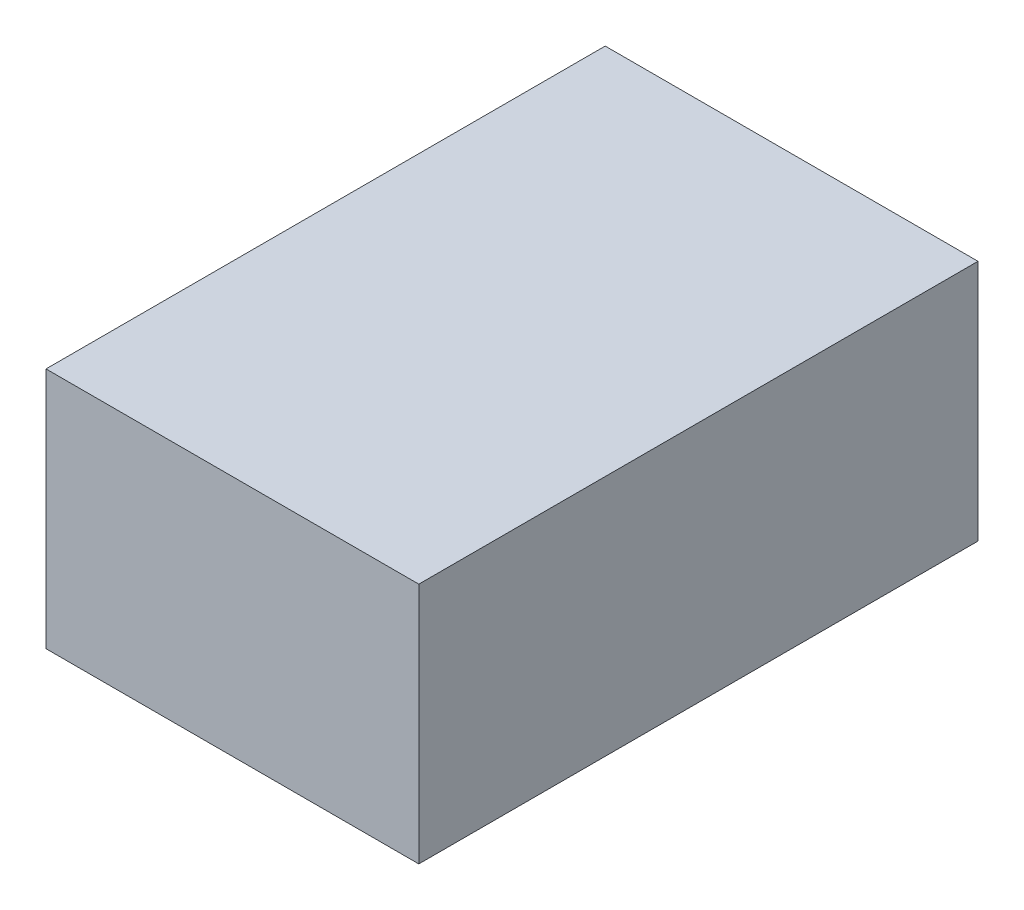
ISO-10303-21;
HEADER;
FILE_DESCRIPTION(('STEP AP214'),'2;1');
FILE_NAME('part.step','',(''),(''),'','','');
FILE_SCHEMA(('AUTOMOTIVE_DESIGN { 1 0 10303 214 1 1 1 1 }'));
ENDSEC;
DATA;
#1=APPLICATION_CONTEXT('core data for automotive mechanical design processes');
#2=APPLICATION_PROTOCOL_DEFINITION('international standard','automotive_design',2000,#1);
#3=PRODUCT_CONTEXT('',#1,'mechanical');
#4=PRODUCT('Part','Part','',(#3));
#5=PRODUCT_RELATED_PRODUCT_CATEGORY('part','',(#4));
#6=PRODUCT_DEFINITION_FORMATION('','',#4);
#7=PRODUCT_DEFINITION_CONTEXT('part definition',#1,'design');
#8=PRODUCT_DEFINITION('design','',#6,#7);
#9=PRODUCT_DEFINITION_SHAPE('','',#8);
#10=(LENGTH_UNIT() NAMED_UNIT(*) SI_UNIT(.MILLI.,.METRE.));
#11=(NAMED_UNIT(*) PLANE_ANGLE_UNIT() SI_UNIT($,.RADIAN.));
#12=(NAMED_UNIT(*) SI_UNIT($,.STERADIAN.) SOLID_ANGLE_UNIT());
#13=UNCERTAINTY_MEASURE_WITH_UNIT(LENGTH_MEASURE(1.E-05),#10,'distance_accuracy_value','');
#14=(GEOMETRIC_REPRESENTATION_CONTEXT(3) GLOBAL_UNCERTAINTY_ASSIGNED_CONTEXT((#13)) GLOBAL_UNIT_ASSIGNED_CONTEXT((#10,
#11,#12)) REPRESENTATION_CONTEXT('',''));
#15=CARTESIAN_POINT('',(0.,0.,0.));
#16=DIRECTION('',(0.,0.,1.));
#17=DIRECTION('',(1.,0.,0.));
#18=AXIS2_PLACEMENT_3D('',#15,#16,#17);
#19=CARTESIAN_POINT('',(0.,0.13,0.));
#20=DIRECTION('',(0.,1.,0.));
#21=DIRECTION('',(1.,0.,0.));
#22=AXIS2_PLACEMENT_3D('',#19,#20,#21);
#23=PLANE('',#22);
#24=DIRECTION('',(1.,0.,0.));
#25=VECTOR('',#24,1.);
#26=CARTESIAN_POINT('',(-0.6,0.13,-0.5));
#27=LINE('',#26,#25);
#28=CARTESIAN_POINT('',(-0.6,0.13,-0.5));
#29=VERTEX_POINT('',#28);
#30=CARTESIAN_POINT('',(-0.4,0.13,-0.5));
#31=VERTEX_POINT('',#30);
#32=EDGE_CURVE('E11',#29,#31,#27,.T.);
#33=ORIENTED_EDGE('',*,*,#32,.T.);
#34=DIRECTION('',(0.,0.,-1.));
#35=VECTOR('',#34,1.);
#36=CARTESIAN_POINT('',(-0.4,0.13,-0.5));
#37=LINE('',#36,#35);
#38=CARTESIAN_POINT('',(-0.4,0.13,-0.8));
#39=VERTEX_POINT('',#38);
#40=EDGE_CURVE('E45',#31,#39,#37,.T.);
#41=ORIENTED_EDGE('',*,*,#40,.T.);
#42=DIRECTION('',(-1.,0.,0.));
#43=VECTOR('',#42,1.);
#44=CARTESIAN_POINT('',(-0.4,0.13,-0.8));
#45=LINE('',#44,#43);
#46=CARTESIAN_POINT('',(-0.6,0.13,-0.8));
#47=VERTEX_POINT('',#46);
#48=EDGE_CURVE('E73',#39,#47,#45,.T.);
#49=ORIENTED_EDGE('',*,*,#48,.T.);
#50=DIRECTION('',(0.,0.,1.));
#51=VECTOR('',#50,1.);
#52=CARTESIAN_POINT('',(-0.6,0.13,-0.8));
#53=LINE('',#52,#51);
#54=EDGE_CURVE('E71',#47,#29,#53,.T.);
#55=ORIENTED_EDGE('',*,*,#54,.T.);
#56=EDGE_LOOP('',(#33,#41,#49,#55));
#57=FACE_BOUND('',#56,.T.);
#58=ADVANCED_FACE('F17',(#57),#23,.T.);
#59=CARTESIAN_POINT('',(-0.6,0.,-0.5));
#60=DIRECTION('',(0.,0.,1.));
#61=DIRECTION('',(1.,0.,0.));
#62=AXIS2_PLACEMENT_3D('',#59,#60,#61);
#63=PLANE('',#62);
#64=DIRECTION('',(0.,1.,0.));
#65=VECTOR('',#64,1.);
#66=CARTESIAN_POINT('',(-0.4,0.,-0.5));
#67=LINE('',#66,#65);
#68=CARTESIAN_POINT('',(-0.4,0.,-0.5));
#69=VERTEX_POINT('',#68);
#70=EDGE_CURVE('E25',#69,#31,#67,.T.);
#71=ORIENTED_EDGE('',*,*,#70,.T.);
#72=ORIENTED_EDGE('',*,*,#32,.F.);
#73=DIRECTION('',(0.,1.,0.));
#74=VECTOR('',#73,1.);
#75=CARTESIAN_POINT('',(-0.6,0.,-0.5));
#76=LINE('',#75,#74);
#77=CARTESIAN_POINT('',(-0.6,0.,-0.5));
#78=VERTEX_POINT('',#77);
#79=EDGE_CURVE('E68',#78,#29,#76,.T.);
#80=ORIENTED_EDGE('',*,*,#79,.F.);
#81=DIRECTION('',(1.,0.,0.));
#82=VECTOR('',#81,1.);
#83=CARTESIAN_POINT('',(-0.6,0.,-0.5));
#84=LINE('',#83,#82);
#85=EDGE_CURVE('E89',#78,#69,#84,.T.);
#86=ORIENTED_EDGE('',*,*,#85,.T.);
#87=EDGE_LOOP('',(#71,#72,#80,#86));
#88=FACE_BOUND('',#87,.T.);
#89=ADVANCED_FACE('F65',(#88),#63,.T.);
#90=CARTESIAN_POINT('',(-0.4,0.,-0.5));
#91=DIRECTION('',(1.,0.,0.));
#92=DIRECTION('',(0.,1.,0.));
#93=AXIS2_PLACEMENT_3D('',#90,#91,#92);
#94=PLANE('',#93);
#95=DIRECTION('',(0.,1.,0.));
#96=VECTOR('',#95,1.);
#97=CARTESIAN_POINT('',(-0.4,0.,-0.8));
#98=LINE('',#97,#96);
#99=CARTESIAN_POINT('',(-0.4,0.,-0.8));
#100=VERTEX_POINT('',#99);
#101=EDGE_CURVE('E97',#100,#39,#98,.T.);
#102=ORIENTED_EDGE('',*,*,#101,.T.);
#103=ORIENTED_EDGE('',*,*,#40,.F.);
#104=ORIENTED_EDGE('',*,*,#70,.F.);
#105=DIRECTION('',(0.,0.,-1.));
#106=VECTOR('',#105,1.);
#107=CARTESIAN_POINT('',(-0.4,0.,-0.5));
#108=LINE('',#107,#106);
#109=EDGE_CURVE('E107',#69,#100,#108,.T.);
#110=ORIENTED_EDGE('',*,*,#109,.T.);
#111=EDGE_LOOP('',(#102,#103,#104,#110));
#112=FACE_BOUND('',#111,.T.);
#113=ADVANCED_FACE('F143',(#112),#94,.T.);
#114=CARTESIAN_POINT('',(-0.4,0.,-0.8));
#115=DIRECTION('',(0.,0.,-1.));
#116=DIRECTION('',(0.,-1.,0.));
#117=AXIS2_PLACEMENT_3D('',#114,#115,#116);
#118=PLANE('',#117);
#119=DIRECTION('',(0.,1.,0.));
#120=VECTOR('',#119,1.);
#121=CARTESIAN_POINT('',(-0.6,0.,-0.8));
#122=LINE('',#121,#120);
#123=CARTESIAN_POINT('',(-0.6,0.,-0.8));
#124=VERTEX_POINT('',#123);
#125=EDGE_CURVE('E77',#124,#47,#122,.T.);
#126=ORIENTED_EDGE('',*,*,#125,.T.);
#127=ORIENTED_EDGE('',*,*,#48,.F.);
#128=ORIENTED_EDGE('',*,*,#101,.F.);
#129=DIRECTION('',(-1.,0.,0.));
#130=VECTOR('',#129,1.);
#131=CARTESIAN_POINT('',(-0.4,0.,-0.8));
#132=LINE('',#131,#130);
#133=EDGE_CURVE('E115',#100,#124,#132,.T.);
#134=ORIENTED_EDGE('',*,*,#133,.T.);
#135=EDGE_LOOP('',(#126,#127,#128,#134));
#136=FACE_BOUND('',#135,.T.);
#137=ADVANCED_FACE('F126',(#136),#118,.T.);
#138=CARTESIAN_POINT('',(-0.6,0.,-0.8));
#139=DIRECTION('',(-1.,0.,0.));
#140=DIRECTION('',(0.,0.,1.));
#141=AXIS2_PLACEMENT_3D('',#138,#139,#140);
#142=PLANE('',#141);
#143=ORIENTED_EDGE('',*,*,#79,.T.);
#144=ORIENTED_EDGE('',*,*,#54,.F.);
#145=ORIENTED_EDGE('',*,*,#125,.F.);
#146=DIRECTION('',(0.,0.,1.));
#147=VECTOR('',#146,1.);
#148=CARTESIAN_POINT('',(-0.6,0.,-0.8));
#149=LINE('',#148,#147);
#150=EDGE_CURVE('E81',#124,#78,#149,.T.);
#151=ORIENTED_EDGE('',*,*,#150,.T.);
#152=EDGE_LOOP('',(#143,#144,#145,#151));
#153=FACE_BOUND('',#152,.T.);
#154=ADVANCED_FACE('F79',(#153),#142,.T.);
#155=CARTESIAN_POINT('',(0.,0.,0.));
#156=DIRECTION('',(0.,1.,0.));
#157=DIRECTION('',(1.,0.,0.));
#158=AXIS2_PLACEMENT_3D('',#155,#156,#157);
#159=PLANE('',#158);
#160=ORIENTED_EDGE('',*,*,#133,.F.);
#161=ORIENTED_EDGE('',*,*,#109,.F.);
#162=ORIENTED_EDGE('',*,*,#85,.F.);
#163=ORIENTED_EDGE('',*,*,#150,.F.);
#164=EDGE_LOOP('',(#160,#161,#162,#163));
#165=FACE_BOUND('',#164,.T.);
#166=ADVANCED_FACE('F128',(#165),#159,.F.);
#167=CLOSED_SHELL('',(#58,#89,#113,#137,#154,#166));
#168=MANIFOLD_SOLID_BREP('B1',#167);
#169=ADVANCED_BREP_SHAPE_REPRESENTATION('',(#18,#168),#14);
#170=SHAPE_DEFINITION_REPRESENTATION(#9,#169);
ENDSEC;
END-ISO-10303-21;
